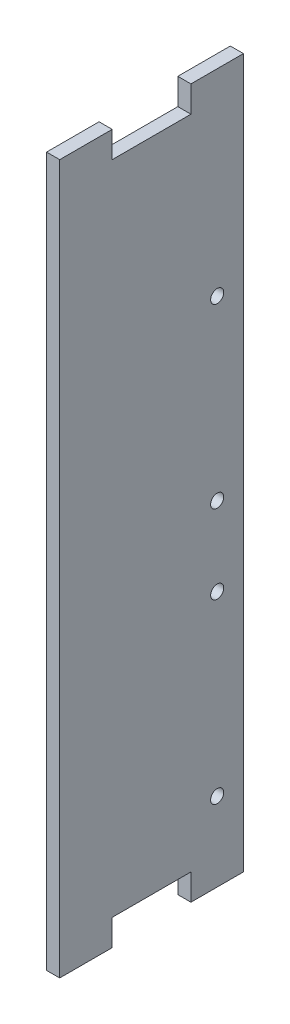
from build123d import *

# Parameters (mm, degrees)
SKETCH1_R      = 1.5875
EXTRUDE1_DEPTH = 3.175


with BuildPart() as part:
    # Sketch1 → Extrude1 (new body)
    with BuildSketch(Plane(origin=(0, 0, 0), x_dir=(0, 0, -1), z_dir=(1, 0, 0))):
        Polygon((-9.525, 0), (9.525, 0), (9.525, -6.35), (22.225, -6.35), (22.225, 165.1), (9.525, 165.1), (9.525, 158.75), (-9.525, 158.75), (-9.525, 165.1), (-22.225, 165.1), (-22.225, -6.35), (-9.525, -6.35), align=None)
        with Locations((15.875, 12.7)):
            Circle(SKETCH1_R, mode=Mode.SUBTRACT)
        with Locations((15.875, 55.5625)):
            Circle(SKETCH1_R, mode=Mode.SUBTRACT)
        with Locations((15.875, 74.6125)):
            Circle(SKETCH1_R, mode=Mode.SUBTRACT)
        with Locations((15.875, 117.475)):
            Circle(SKETCH1_R, mode=Mode.SUBTRACT)
    extrude(amount=EXTRUDE1_DEPTH)


solid = part.part
